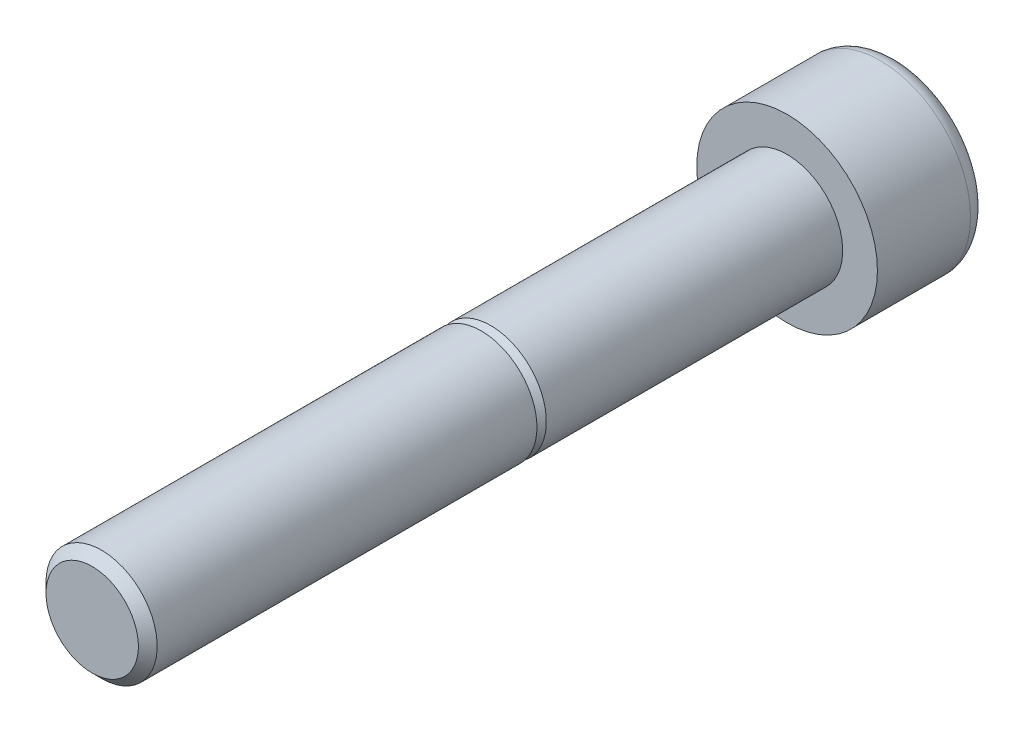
ISO-10303-21;
HEADER;
FILE_DESCRIPTION(('STEP AP214'),'2;1');
FILE_NAME('part.step','',(''),(''),'','','');
FILE_SCHEMA(('AUTOMOTIVE_DESIGN { 1 0 10303 214 1 1 1 1 }'));
ENDSEC;
DATA;
#1=APPLICATION_CONTEXT('core data for automotive mechanical design processes');
#2=APPLICATION_PROTOCOL_DEFINITION('international standard','automotive_design',2000,#1);
#3=PRODUCT_CONTEXT('',#1,'mechanical');
#4=PRODUCT('Part','Part','',(#3));
#5=PRODUCT_RELATED_PRODUCT_CATEGORY('part','',(#4));
#6=PRODUCT_DEFINITION_FORMATION('','',#4);
#7=PRODUCT_DEFINITION_CONTEXT('part definition',#1,'design');
#8=PRODUCT_DEFINITION('design','',#6,#7);
#9=PRODUCT_DEFINITION_SHAPE('','',#8);
#10=(LENGTH_UNIT() NAMED_UNIT(*) SI_UNIT(.MILLI.,.METRE.));
#11=(NAMED_UNIT(*) PLANE_ANGLE_UNIT() SI_UNIT($,.RADIAN.));
#12=(NAMED_UNIT(*) SI_UNIT($,.STERADIAN.) SOLID_ANGLE_UNIT());
#13=UNCERTAINTY_MEASURE_WITH_UNIT(LENGTH_MEASURE(1.E-05),#10,'distance_accuracy_value','');
#14=(GEOMETRIC_REPRESENTATION_CONTEXT(3) GLOBAL_UNCERTAINTY_ASSIGNED_CONTEXT((#13)) GLOBAL_UNIT_ASSIGNED_CONTEXT((#10,
#11,#12)) REPRESENTATION_CONTEXT('',''));
#15=CARTESIAN_POINT('',(0.,0.,0.));
#16=DIRECTION('',(0.,0.,1.));
#17=DIRECTION('',(1.,0.,0.));
#18=AXIS2_PLACEMENT_3D('',#15,#16,#17);
#19=CARTESIAN_POINT('',(0.,0.,0.));
#20=DIRECTION('',(0.,0.,-1.));
#21=DIRECTION('',(-1.,0.,0.));
#22=AXIS2_PLACEMENT_3D('',#19,#20,#21);
#23=PLANE('',#22);
#24=CARTESIAN_POINT('',(0.,0.,0.));
#25=DIRECTION('',(0.,0.,-1.));
#26=DIRECTION('',(-1.,0.,0.));
#27=AXIS2_PLACEMENT_3D('',#24,#25,#26);
#28=CIRCLE('',#27,6.5);
#29=CARTESIAN_POINT('',(-6.5,0.,0.));
#30=VERTEX_POINT('',#29);
#31=EDGE_CURVE('E107',#30,#30,#28,.T.);
#32=ORIENTED_EDGE('',*,*,#31,.F.);
#33=EDGE_LOOP('',(#32));
#34=FACE_BOUND('',#33,.T.);
#35=CARTESIAN_POINT('',(0.,0.,0.));
#36=DIRECTION('',(0.,0.,-1.));
#37=DIRECTION('',(-1.,0.,0.));
#38=AXIS2_PLACEMENT_3D('',#35,#36,#37);
#39=CIRCLE('',#38,4.);
#40=CARTESIAN_POINT('',(-4.,0.,0.));
#41=VERTEX_POINT('',#40);
#42=EDGE_CURVE('E9',#41,#41,#39,.F.);
#43=ORIENTED_EDGE('',*,*,#42,.F.);
#44=EDGE_LOOP('',(#43));
#45=FACE_BOUND('',#44,.T.);
#46=ADVANCED_FACE('F14',(#34,#45),#23,.F.);
#47=CARTESIAN_POINT('',(0.,5.2,-8.));
#48=DIRECTION('',(0.,0.,1.));
#49=DIRECTION('',(1.,0.,0.));
#50=AXIS2_PLACEMENT_3D('',#47,#48,#49);
#51=PLANE('',#50);
#52=CARTESIAN_POINT('',(0.,0.,-8.));
#53=DIRECTION('',(0.,0.,-1.));
#54=DIRECTION('',(-1.,0.,0.));
#55=AXIS2_PLACEMENT_3D('',#52,#53,#54);
#56=CIRCLE('',#55,5.2);
#57=CARTESIAN_POINT('',(-5.2,0.,-8.));
#58=VERTEX_POINT('',#57);
#59=EDGE_CURVE('E89',#58,#58,#56,.T.);
#60=ORIENTED_EDGE('',*,*,#59,.T.);
#61=EDGE_LOOP('',(#60));
#62=FACE_BOUND('',#61,.T.);
#63=DIRECTION('',(-0.866025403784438,0.5,0.));
#64=VECTOR('',#63,1.);
#65=CARTESIAN_POINT('',(-3.75166604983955,-1.29807621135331,-8.));
#66=LINE('',#65,#64);
#67=CARTESIAN_POINT('',(0.,-3.46410161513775,-8.));
#68=VERTEX_POINT('',#67);
#69=CARTESIAN_POINT('',(-3.,-1.73205080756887,-8.));
#70=VERTEX_POINT('',#69);
#71=EDGE_CURVE('E23',#68,#70,#66,.T.);
#72=ORIENTED_EDGE('',*,*,#71,.F.);
#73=DIRECTION('',(-0.866025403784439,-0.5,0.));
#74=VECTOR('',#73,1.);
#75=CARTESIAN_POINT('',(3.75166604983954,-1.29807621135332,-8.));
#76=LINE('',#75,#74);
#77=CARTESIAN_POINT('',(3.,-1.73205080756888,-8.));
#78=VERTEX_POINT('',#77);
#79=EDGE_CURVE('E38',#78,#68,#76,.T.);
#80=ORIENTED_EDGE('',*,*,#79,.F.);
#81=DIRECTION('',(0.,-1.,0.));
#82=VECTOR('',#81,1.);
#83=CARTESIAN_POINT('',(3.,5.2,-8.));
#84=LINE('',#83,#82);
#85=CARTESIAN_POINT('',(3.,1.73205080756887,-8.));
#86=VERTEX_POINT('',#85);
#87=EDGE_CURVE('E120',#86,#78,#84,.T.);
#88=ORIENTED_EDGE('',*,*,#87,.F.);
#89=DIRECTION('',(0.866025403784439,-0.5,0.));
#90=VECTOR('',#89,1.);
#91=CARTESIAN_POINT('',(-0.751666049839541,3.89807621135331,-8.));
#92=LINE('',#91,#90);
#93=CARTESIAN_POINT('',(0.,3.46410161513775,-8.));
#94=VERTEX_POINT('',#93);
#95=EDGE_CURVE('E117',#94,#86,#92,.T.);
#96=ORIENTED_EDGE('',*,*,#95,.F.);
#97=DIRECTION('',(0.866025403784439,0.5,0.));
#98=VECTOR('',#97,1.);
#99=CARTESIAN_POINT('',(0.75166604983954,3.89807621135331,-8.));
#100=LINE('',#99,#98);
#101=CARTESIAN_POINT('',(-3.,1.73205080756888,-8.));
#102=VERTEX_POINT('',#101);
#103=EDGE_CURVE('E114',#102,#94,#100,.T.);
#104=ORIENTED_EDGE('',*,*,#103,.F.);
#105=DIRECTION('',(0.,1.,0.));
#106=VECTOR('',#105,1.);
#107=CARTESIAN_POINT('',(-3.,5.2,-8.));
#108=LINE('',#107,#106);
#109=EDGE_CURVE('E111',#70,#102,#108,.T.);
#110=ORIENTED_EDGE('',*,*,#109,.F.);
#111=EDGE_LOOP('',(#72,#80,#88,#96,#104,#110));
#112=FACE_BOUND('',#111,.T.);
#113=ADVANCED_FACE('F16',(#62,#112),#51,.F.);
#114=CARTESIAN_POINT('',(0.,0.,-8.));
#115=DIRECTION('',(0.,0.,-1.));
#116=DIRECTION('',(-1.,0.,0.));
#117=AXIS2_PLACEMENT_3D('',#114,#115,#116);
#118=CYLINDRICAL_SURFACE('',#117,6.5);
#119=CARTESIAN_POINT('',(0.,0.,-6.7));
#120=DIRECTION('',(0.,0.,-1.));
#121=DIRECTION('',(-1.,0.,0.));
#122=AXIS2_PLACEMENT_3D('',#119,#120,#121);
#123=CIRCLE('',#122,6.5);
#124=CARTESIAN_POINT('',(-6.5,0.,-6.7));
#125=VERTEX_POINT('',#124);
#126=EDGE_CURVE('E97',#125,#125,#123,.T.);
#127=ORIENTED_EDGE('',*,*,#126,.F.);
#128=EDGE_LOOP('',(#127));
#129=FACE_BOUND('',#128,.T.);
#130=ORIENTED_EDGE('',*,*,#31,.T.);
#131=EDGE_LOOP('',(#130));
#132=FACE_BOUND('',#131,.T.);
#133=ADVANCED_FACE('F236',(#129,#132),#118,.T.);
#134=CARTESIAN_POINT('',(0.,0.,-6.7));
#135=DIRECTION('',(0.,0.,-1.));
#136=DIRECTION('',(-1.,0.,0.));
#137=AXIS2_PLACEMENT_3D('',#134,#135,#136);
#138=TOROIDAL_SURFACE('',#137,5.2,1.3);
#139=ORIENTED_EDGE('',*,*,#59,.F.);
#140=EDGE_LOOP('',(#139));
#141=FACE_BOUND('',#140,.T.);
#142=ORIENTED_EDGE('',*,*,#126,.T.);
#143=EDGE_LOOP('',(#142));
#144=FACE_BOUND('',#143,.T.);
#145=ADVANCED_FACE('F243',(#141,#144),#138,.T.);
#146=CARTESIAN_POINT('',(-3.,-1.73205080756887,-4.));
#147=DIRECTION('',(0.5,0.866025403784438,0.));
#148=DIRECTION('',(-0.866025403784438,0.5,0.));
#149=AXIS2_PLACEMENT_3D('',#146,#147,#148);
#150=PLANE('',#149);
#151=ORIENTED_EDGE('',*,*,#71,.T.);
#152=DIRECTION('',(0.,0.,-1.));
#153=VECTOR('',#152,1.);
#154=CARTESIAN_POINT('',(-3.,-1.73205080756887,-4.));
#155=LINE('',#154,#153);
#156=CARTESIAN_POINT('',(-3.,-1.73205080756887,-4.));
#157=VERTEX_POINT('',#156);
#158=EDGE_CURVE('E30',#157,#70,#155,.T.);
#159=ORIENTED_EDGE('',*,*,#158,.F.);
#160=DIRECTION('',(0.866025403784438,-0.5,0.));
#161=VECTOR('',#160,1.);
#162=CARTESIAN_POINT('',(-3.,-1.73205080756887,-4.));
#163=LINE('',#162,#161);
#164=CARTESIAN_POINT('',(0.,-3.46410161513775,-4.));
#165=VERTEX_POINT('',#164);
#166=EDGE_CURVE('E74',#157,#165,#163,.T.);
#167=ORIENTED_EDGE('',*,*,#166,.T.);
#168=DIRECTION('',(0.,0.,-1.));
#169=VECTOR('',#168,1.);
#170=CARTESIAN_POINT('',(0.,-3.46410161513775,-4.));
#171=LINE('',#170,#169);
#172=EDGE_CURVE('E82',#165,#68,#171,.T.);
#173=ORIENTED_EDGE('',*,*,#172,.T.);
#174=EDGE_LOOP('',(#151,#159,#167,#173));
#175=FACE_BOUND('',#174,.T.);
#176=ADVANCED_FACE('F81',(#175),#150,.T.);
#177=CARTESIAN_POINT('',(0.,-3.46410161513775,-4.));
#178=DIRECTION('',(-0.5,0.866025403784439,0.));
#179=DIRECTION('',(-0.866025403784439,-0.5,0.));
#180=AXIS2_PLACEMENT_3D('',#177,#178,#179);
#181=PLANE('',#180);
#182=ORIENTED_EDGE('',*,*,#79,.T.);
#183=ORIENTED_EDGE('',*,*,#172,.F.);
#184=DIRECTION('',(0.866025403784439,0.5,0.));
#185=VECTOR('',#184,1.);
#186=CARTESIAN_POINT('',(0.,-3.46410161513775,-4.));
#187=LINE('',#186,#185);
#188=CARTESIAN_POINT('',(3.,-1.73205080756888,-4.));
#189=VERTEX_POINT('',#188);
#190=EDGE_CURVE('E70',#165,#189,#187,.T.);
#191=ORIENTED_EDGE('',*,*,#190,.T.);
#192=DIRECTION('',(0.,0.,-1.));
#193=VECTOR('',#192,1.);
#194=CARTESIAN_POINT('',(3.,-1.73205080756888,-4.));
#195=LINE('',#194,#193);
#196=EDGE_CURVE('E90',#189,#78,#195,.T.);
#197=ORIENTED_EDGE('',*,*,#196,.T.);
#198=EDGE_LOOP('',(#182,#183,#191,#197));
#199=FACE_BOUND('',#198,.T.);
#200=ADVANCED_FACE('F87',(#199),#181,.T.);
#201=CARTESIAN_POINT('',(3.,-1.73205080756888,-4.));
#202=DIRECTION('',(-1.,0.,0.));
#203=DIRECTION('',(0.,-1.,0.));
#204=AXIS2_PLACEMENT_3D('',#201,#202,#203);
#205=PLANE('',#204);
#206=ORIENTED_EDGE('',*,*,#87,.T.);
#207=ORIENTED_EDGE('',*,*,#196,.F.);
#208=DIRECTION('',(0.,1.,0.));
#209=VECTOR('',#208,1.);
#210=CARTESIAN_POINT('',(3.,-1.73205080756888,-4.));
#211=LINE('',#210,#209);
#212=CARTESIAN_POINT('',(3.,1.73205080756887,-4.));
#213=VERTEX_POINT('',#212);
#214=EDGE_CURVE('E76',#189,#213,#211,.T.);
#215=ORIENTED_EDGE('',*,*,#214,.T.);
#216=DIRECTION('',(0.,0.,-1.));
#217=VECTOR('',#216,1.);
#218=CARTESIAN_POINT('',(3.,1.73205080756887,-4.));
#219=LINE('',#218,#217);
#220=EDGE_CURVE('E100',#213,#86,#219,.T.);
#221=ORIENTED_EDGE('',*,*,#220,.T.);
#222=EDGE_LOOP('',(#206,#207,#215,#221));
#223=FACE_BOUND('',#222,.T.);
#224=ADVANCED_FACE('F159',(#223),#205,.T.);
#225=CARTESIAN_POINT('',(3.,1.73205080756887,-4.));
#226=DIRECTION('',(-0.5,-0.866025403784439,0.));
#227=DIRECTION('',(0.866025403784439,-0.5,0.));
#228=AXIS2_PLACEMENT_3D('',#225,#226,#227);
#229=PLANE('',#228);
#230=ORIENTED_EDGE('',*,*,#95,.T.);
#231=ORIENTED_EDGE('',*,*,#220,.F.);
#232=DIRECTION('',(-0.866025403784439,0.5,0.));
#233=VECTOR('',#232,1.);
#234=CARTESIAN_POINT('',(3.,1.73205080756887,-4.));
#235=LINE('',#234,#233);
#236=CARTESIAN_POINT('',(0.,3.46410161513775,-4.));
#237=VERTEX_POINT('',#236);
#238=EDGE_CURVE('E162',#213,#237,#235,.T.);
#239=ORIENTED_EDGE('',*,*,#238,.T.);
#240=DIRECTION('',(0.,0.,-1.));
#241=VECTOR('',#240,1.);
#242=CARTESIAN_POINT('',(0.,3.46410161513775,-4.));
#243=LINE('',#242,#241);
#244=EDGE_CURVE('E141',#237,#94,#243,.T.);
#245=ORIENTED_EDGE('',*,*,#244,.T.);
#246=EDGE_LOOP('',(#230,#231,#239,#245));
#247=FACE_BOUND('',#246,.T.);
#248=ADVANCED_FACE('F161',(#247),#229,.T.);
#249=CARTESIAN_POINT('',(0.,3.46410161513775,-4.));
#250=DIRECTION('',(0.5,-0.866025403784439,0.));
#251=DIRECTION('',(0.866025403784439,0.5,0.));
#252=AXIS2_PLACEMENT_3D('',#249,#250,#251);
#253=PLANE('',#252);
#254=ORIENTED_EDGE('',*,*,#103,.T.);
#255=ORIENTED_EDGE('',*,*,#244,.F.);
#256=DIRECTION('',(-0.866025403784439,-0.5,0.));
#257=VECTOR('',#256,1.);
#258=CARTESIAN_POINT('',(0.,3.46410161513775,-4.));
#259=LINE('',#258,#257);
#260=CARTESIAN_POINT('',(-3.,1.73205080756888,-4.));
#261=VERTEX_POINT('',#260);
#262=EDGE_CURVE('E139',#237,#261,#259,.T.);
#263=ORIENTED_EDGE('',*,*,#262,.T.);
#264=DIRECTION('',(0.,0.,-1.));
#265=VECTOR('',#264,1.);
#266=CARTESIAN_POINT('',(-3.,1.73205080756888,-4.));
#267=LINE('',#266,#265);
#268=EDGE_CURVE('E133',#261,#102,#267,.T.);
#269=ORIENTED_EDGE('',*,*,#268,.T.);
#270=EDGE_LOOP('',(#254,#255,#263,#269));
#271=FACE_BOUND('',#270,.T.);
#272=ADVANCED_FACE('F135',(#271),#253,.T.);
#273=CARTESIAN_POINT('',(-3.,1.73205080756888,-4.));
#274=DIRECTION('',(1.,0.,0.));
#275=DIRECTION('',(0.,1.,0.));
#276=AXIS2_PLACEMENT_3D('',#273,#274,#275);
#277=PLANE('',#276);
#278=ORIENTED_EDGE('',*,*,#109,.T.);
#279=ORIENTED_EDGE('',*,*,#268,.F.);
#280=DIRECTION('',(0.,-1.,0.));
#281=VECTOR('',#280,1.);
#282=CARTESIAN_POINT('',(-3.,1.73205080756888,-4.));
#283=LINE('',#282,#281);
#284=EDGE_CURVE('E149',#261,#157,#283,.T.);
#285=ORIENTED_EDGE('',*,*,#284,.T.);
#286=ORIENTED_EDGE('',*,*,#158,.T.);
#287=EDGE_LOOP('',(#278,#279,#285,#286));
#288=FACE_BOUND('',#287,.T.);
#289=ADVANCED_FACE('F132',(#288),#277,.T.);
#290=CARTESIAN_POINT('',(0.,-3.46410161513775,-4.));
#291=DIRECTION('',(0.,0.,1.));
#292=DIRECTION('',(-1.,0.,0.));
#293=AXIS2_PLACEMENT_3D('',#290,#291,#292);
#294=PLANE('',#293);
#295=ORIENTED_EDGE('',*,*,#166,.F.);
#296=ORIENTED_EDGE('',*,*,#284,.F.);
#297=ORIENTED_EDGE('',*,*,#262,.F.);
#298=ORIENTED_EDGE('',*,*,#238,.F.);
#299=ORIENTED_EDGE('',*,*,#214,.F.);
#300=ORIENTED_EDGE('',*,*,#190,.F.);
#301=EDGE_LOOP('',(#295,#296,#297,#298,#299,#300));
#302=FACE_BOUND('',#301,.T.);
#303=ADVANCED_FACE('F72',(#302),#294,.F.);
#304=CARTESIAN_POINT('',(0.,0.,0.));
#305=DIRECTION('',(0.,0.,-1.));
#306=DIRECTION('',(-1.,0.,0.));
#307=AXIS2_PLACEMENT_3D('',#304,#305,#306);
#308=CYLINDRICAL_SURFACE('',#307,4.);
#309=CARTESIAN_POINT('',(0.,0.,21.3232169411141));
#310=DIRECTION('',(0.,0.,-1.));
#311=DIRECTION('',(-1.,0.,0.));
#312=AXIS2_PLACEMENT_3D('',#309,#310,#311);
#313=CIRCLE('',#312,4.);
#314=CARTESIAN_POINT('',(-4.,0.,21.3232169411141));
#315=VERTEX_POINT('',#314);
#316=EDGE_CURVE('E187',#315,#315,#313,.T.);
#317=ORIENTED_EDGE('',*,*,#316,.T.);
#318=EDGE_LOOP('',(#317));
#319=FACE_BOUND('',#318,.T.);
#320=ORIENTED_EDGE('',*,*,#42,.T.);
#321=EDGE_LOOP('',(#320));
#322=FACE_BOUND('',#321,.T.);
#323=ADVANCED_FACE('F195',(#319,#322),#308,.T.);
#324=CARTESIAN_POINT('',(0.,0.,50.));
#325=DIRECTION('',(0.,0.,-1.));
#326=DIRECTION('',(-1.,0.,0.));
#327=AXIS2_PLACEMENT_3D('',#324,#325,#326);
#328=PLANE('',#327);
#329=CARTESIAN_POINT('',(0.,0.,50.));
#330=DIRECTION('',(0.,0.,-1.));
#331=DIRECTION('',(-1.,0.,0.));
#332=AXIS2_PLACEMENT_3D('',#329,#330,#331);
#333=CIRCLE('',#332,3.32321694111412);
#334=CARTESIAN_POINT('',(-3.32321694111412,0.,50.));
#335=VERTEX_POINT('',#334);
#336=EDGE_CURVE('E85',#335,#335,#333,.T.);
#337=ORIENTED_EDGE('',*,*,#336,.F.);
#338=EDGE_LOOP('',(#337));
#339=FACE_BOUND('',#338,.T.);
#340=ADVANCED_FACE('F219',(#339),#328,.F.);
#341=CARTESIAN_POINT('',(0.,0.,50.));
#342=DIRECTION('',(0.,0.,-1.));
#343=DIRECTION('',(-1.,0.,0.));
#344=AXIS2_PLACEMENT_3D('',#341,#342,#343);
#345=CONICAL_SURFACE('',#344,3.32321694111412,0.785398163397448);
#346=CARTESIAN_POINT('',(0.,0.,49.3232169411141));
#347=DIRECTION('',(0.,0.,-1.));
#348=DIRECTION('',(-1.,0.,0.));
#349=AXIS2_PLACEMENT_3D('',#346,#347,#348);
#350=CIRCLE('',#349,4.);
#351=CARTESIAN_POINT('',(-4.,0.,49.3232169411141));
#352=VERTEX_POINT('',#351);
#353=EDGE_CURVE('E175',#352,#352,#350,.T.);
#354=ORIENTED_EDGE('',*,*,#353,.F.);
#355=EDGE_LOOP('',(#354));
#356=FACE_BOUND('',#355,.T.);
#357=ORIENTED_EDGE('',*,*,#336,.T.);
#358=EDGE_LOOP('',(#357));
#359=FACE_BOUND('',#358,.T.);
#360=ADVANCED_FACE('F213',(#356,#359),#345,.T.);
#361=CARTESIAN_POINT('',(0.,0.,0.));
#362=DIRECTION('',(0.,0.,-1.));
#363=DIRECTION('',(-1.,0.,0.));
#364=AXIS2_PLACEMENT_3D('',#361,#362,#363);
#365=CYLINDRICAL_SURFACE('',#364,4.);
#366=CARTESIAN_POINT('',(0.,0.,22.));
#367=DIRECTION('',(0.,0.,-1.));
#368=DIRECTION('',(-1.,0.,0.));
#369=AXIS2_PLACEMENT_3D('',#366,#367,#368);
#370=CIRCLE('',#369,4.);
#371=CARTESIAN_POINT('',(-4.,0.,22.));
#372=VERTEX_POINT('',#371);
#373=EDGE_CURVE('E179',#372,#372,#370,.T.);
#374=ORIENTED_EDGE('',*,*,#373,.F.);
#375=EDGE_LOOP('',(#374));
#376=FACE_BOUND('',#375,.T.);
#377=ORIENTED_EDGE('',*,*,#353,.T.);
#378=EDGE_LOOP('',(#377));
#379=FACE_BOUND('',#378,.T.);
#380=ADVANCED_FACE('F207',(#376,#379),#365,.T.);
#381=CARTESIAN_POINT('',(0.,4.,22.));
#382=DIRECTION('',(0.,0.,1.));
#383=DIRECTION('',(1.,0.,0.));
#384=AXIS2_PLACEMENT_3D('',#381,#382,#383);
#385=PLANE('',#384);
#386=CARTESIAN_POINT('',(0.,0.,22.));
#387=DIRECTION('',(0.,0.,-1.));
#388=DIRECTION('',(-1.,0.,0.));
#389=AXIS2_PLACEMENT_3D('',#386,#387,#388);
#390=CIRCLE('',#389,3.32321694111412);
#391=CARTESIAN_POINT('',(-3.32321694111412,0.,22.));
#392=VERTEX_POINT('',#391);
#393=EDGE_CURVE('E183',#392,#392,#390,.T.);
#394=ORIENTED_EDGE('',*,*,#393,.F.);
#395=EDGE_LOOP('',(#394));
#396=FACE_BOUND('',#395,.T.);
#397=ORIENTED_EDGE('',*,*,#373,.T.);
#398=EDGE_LOOP('',(#397));
#399=FACE_BOUND('',#398,.T.);
#400=ADVANCED_FACE('F201',(#396,#399),#385,.F.);
#401=CARTESIAN_POINT('',(0.,0.,22.));
#402=DIRECTION('',(0.,0.,-1.));
#403=DIRECTION('',(-1.,0.,0.));
#404=AXIS2_PLACEMENT_3D('',#401,#402,#403);
#405=CONICAL_SURFACE('',#404,3.32321694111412,0.785398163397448);
#406=ORIENTED_EDGE('',*,*,#316,.F.);
#407=EDGE_LOOP('',(#406));
#408=FACE_BOUND('',#407,.T.);
#409=ORIENTED_EDGE('',*,*,#393,.T.);
#410=EDGE_LOOP('',(#409));
#411=FACE_BOUND('',#410,.T.);
#412=ADVANCED_FACE('F198',(#408,#411),#405,.T.);
#413=CLOSED_SHELL('',(#46,#113,#133,#145,#176,#200,#224,#248,#272,#289,#303,#323,#340,#360,#380,
#400,#412));
#414=MANIFOLD_SOLID_BREP('B1',#413);
#415=ADVANCED_BREP_SHAPE_REPRESENTATION('',(#18,#414),#14);
#416=SHAPE_DEFINITION_REPRESENTATION(#9,#415);
ENDSEC;
END-ISO-10303-21;
